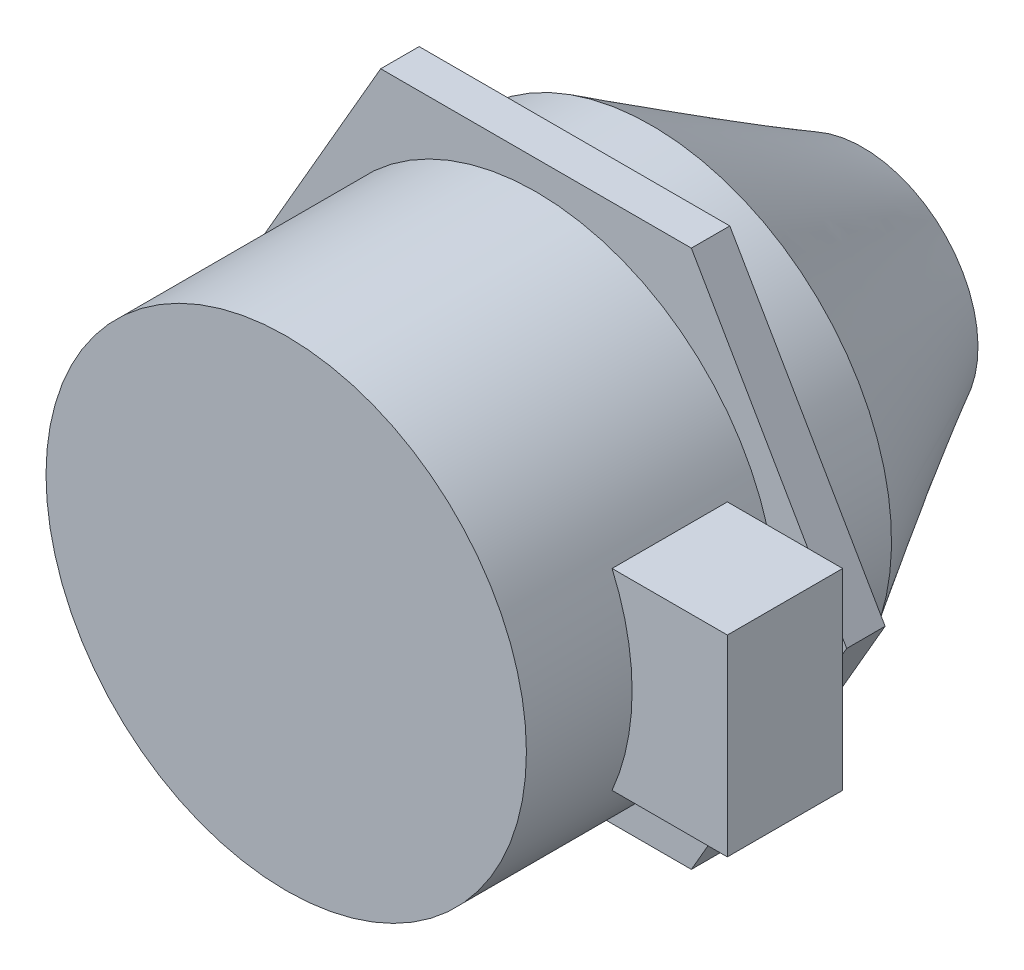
ISO-10303-21;
HEADER;
FILE_DESCRIPTION(('STEP AP214'),'2;1');
FILE_NAME('part.step','',(''),(''),'','','');
FILE_SCHEMA(('AUTOMOTIVE_DESIGN { 1 0 10303 214 1 1 1 1 }'));
ENDSEC;
DATA;
#1=APPLICATION_CONTEXT('core data for automotive mechanical design processes');
#2=APPLICATION_PROTOCOL_DEFINITION('international standard','automotive_design',2000,#1);
#3=PRODUCT_CONTEXT('',#1,'mechanical');
#4=PRODUCT('Part','Part','',(#3));
#5=PRODUCT_RELATED_PRODUCT_CATEGORY('part','',(#4));
#6=PRODUCT_DEFINITION_FORMATION('','',#4);
#7=PRODUCT_DEFINITION_CONTEXT('part definition',#1,'design');
#8=PRODUCT_DEFINITION('design','',#6,#7);
#9=PRODUCT_DEFINITION_SHAPE('','',#8);
#10=(LENGTH_UNIT() NAMED_UNIT(*) SI_UNIT(.MILLI.,.METRE.));
#11=(NAMED_UNIT(*) PLANE_ANGLE_UNIT() SI_UNIT($,.RADIAN.));
#12=(NAMED_UNIT(*) SI_UNIT($,.STERADIAN.) SOLID_ANGLE_UNIT());
#13=UNCERTAINTY_MEASURE_WITH_UNIT(LENGTH_MEASURE(1.E-05),#10,'distance_accuracy_value','');
#14=(GEOMETRIC_REPRESENTATION_CONTEXT(3) GLOBAL_UNCERTAINTY_ASSIGNED_CONTEXT((#13)) GLOBAL_UNIT_ASSIGNED_CONTEXT((#10,
#11,#12)) REPRESENTATION_CONTEXT('',''));
#15=CARTESIAN_POINT('',(0.,0.,0.));
#16=DIRECTION('',(0.,0.,1.));
#17=DIRECTION('',(1.,0.,0.));
#18=AXIS2_PLACEMENT_3D('',#15,#16,#17);
#19=CARTESIAN_POINT('',(0.,0.,-130.));
#20=DIRECTION('',(0.,0.,1.));
#21=DIRECTION('',(1.,0.,0.));
#22=AXIS2_PLACEMENT_3D('',#19,#20,#21);
#23=CYLINDRICAL_SURFACE('',#22,125.);
#24=CARTESIAN_POINT('',(0.,0.,-115.));
#25=DIRECTION('',(0.,0.,-1.));
#26=DIRECTION('',(-1.,0.,0.));
#27=AXIS2_PLACEMENT_3D('',#24,#25,#26);
#28=CIRCLE('',#27,125.);
#29=CARTESIAN_POINT('',(114.564392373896,50.,-115.));
#30=VERTEX_POINT('',#29);
#31=CARTESIAN_POINT('',(114.564392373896,-50.,-115.));
#32=VERTEX_POINT('',#31);
#33=EDGE_CURVE('E223',#30,#32,#28,.T.);
#34=ORIENTED_EDGE('',*,*,#33,.T.);
#35=DIRECTION('',(0.,0.,1.));
#36=VECTOR('',#35,1.);
#37=CARTESIAN_POINT('',(114.564392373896,-50.,-115.));
#38=LINE('',#37,#36);
#39=CARTESIAN_POINT('',(114.564392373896,-50.,-55.));
#40=VERTEX_POINT('',#39);
#41=EDGE_CURVE('E179',#32,#40,#38,.T.);
#42=ORIENTED_EDGE('',*,*,#41,.T.);
#43=CARTESIAN_POINT('',(0.,0.,-55.));
#44=DIRECTION('',(0.,0.,-1.));
#45=DIRECTION('',(-1.,0.,0.));
#46=AXIS2_PLACEMENT_3D('',#43,#44,#45);
#47=CIRCLE('',#46,125.);
#48=CARTESIAN_POINT('',(114.564392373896,50.,-55.));
#49=VERTEX_POINT('',#48);
#50=EDGE_CURVE('E380',#49,#40,#47,.T.);
#51=ORIENTED_EDGE('',*,*,#50,.F.);
#52=DIRECTION('',(0.,0.,1.));
#53=VECTOR('',#52,1.);
#54=CARTESIAN_POINT('',(114.564392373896,50.,-115.));
#55=LINE('',#54,#53);
#56=EDGE_CURVE('E372',#30,#49,#55,.T.);
#57=ORIENTED_EDGE('',*,*,#56,.F.);
#58=EDGE_LOOP('',(#34,#42,#51,#57));
#59=FACE_BOUND('',#58,.T.);
#60=CARTESIAN_POINT('',(0.,0.,-130.));
#61=DIRECTION('',(0.,0.,1.));
#62=DIRECTION('',(1.,0.,0.));
#63=AXIS2_PLACEMENT_3D('',#60,#61,#62);
#64=CIRCLE('',#63,125.);
#65=CARTESIAN_POINT('',(125.,0.,-130.));
#66=VERTEX_POINT('',#65);
#67=EDGE_CURVE('E164',#66,#66,#64,.T.);
#68=ORIENTED_EDGE('',*,*,#67,.T.);
#69=EDGE_LOOP('',(#68));
#70=FACE_BOUND('',#69,.T.);
#71=CARTESIAN_POINT('',(0.,0.,0.));
#72=DIRECTION('',(0.,0.,1.));
#73=DIRECTION('',(1.,0.,0.));
#74=AXIS2_PLACEMENT_3D('',#71,#72,#73);
#75=CIRCLE('',#74,125.);
#76=CARTESIAN_POINT('',(125.,0.,0.));
#77=VERTEX_POINT('',#76);
#78=EDGE_CURVE('E52',#77,#77,#75,.T.);
#79=ORIENTED_EDGE('',*,*,#78,.F.);
#80=EDGE_LOOP('',(#79));
#81=FACE_BOUND('',#80,.T.);
#82=ADVANCED_FACE('F44',(#59,#70,#81),#23,.T.);
#83=CARTESIAN_POINT('',(0.,0.,0.));
#84=DIRECTION('',(0.,0.,1.));
#85=DIRECTION('',(1.,0.,0.));
#86=AXIS2_PLACEMENT_3D('',#83,#84,#85);
#87=PLANE('',#86);
#88=ORIENTED_EDGE('',*,*,#78,.T.);
#89=EDGE_LOOP('',(#88));
#90=FACE_BOUND('',#89,.T.);
#91=ADVANCED_FACE('F203',(#90),#87,.T.);
#92=CARTESIAN_POINT('',(-161.658075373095,0.,-150.));
#93=DIRECTION('',(0.866025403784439,-0.5,0.));
#94=DIRECTION('',(0.5,0.866025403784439,0.));
#95=AXIS2_PLACEMENT_3D('',#92,#93,#94);
#96=PLANE('',#95);
#97=DIRECTION('',(0.5,0.866025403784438,0.));
#98=VECTOR('',#97,1.);
#99=CARTESIAN_POINT('',(-161.658075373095,0.,-130.));
#100=LINE('',#99,#98);
#101=CARTESIAN_POINT('',(-161.658075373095,0.,-130.));
#102=VERTEX_POINT('',#101);
#103=CARTESIAN_POINT('',(-80.8290376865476,140.,-130.));
#104=VERTEX_POINT('',#103);
#105=EDGE_CURVE('E143',#102,#104,#100,.T.);
#106=ORIENTED_EDGE('',*,*,#105,.T.);
#107=DIRECTION('',(0.,0.,1.));
#108=VECTOR('',#107,1.);
#109=CARTESIAN_POINT('',(-80.8290376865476,140.,-150.));
#110=LINE('',#109,#108);
#111=CARTESIAN_POINT('',(-80.8290376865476,140.,-150.));
#112=VERTEX_POINT('',#111);
#113=EDGE_CURVE('E162',#112,#104,#110,.T.);
#114=ORIENTED_EDGE('',*,*,#113,.F.);
#115=DIRECTION('',(0.5,0.866025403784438,0.));
#116=VECTOR('',#115,1.);
#117=CARTESIAN_POINT('',(-161.658075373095,0.,-150.));
#118=LINE('',#117,#116);
#119=CARTESIAN_POINT('',(-161.658075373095,0.,-150.));
#120=VERTEX_POINT('',#119);
#121=EDGE_CURVE('E155',#120,#112,#118,.T.);
#122=ORIENTED_EDGE('',*,*,#121,.F.);
#123=DIRECTION('',(0.,0.,1.));
#124=VECTOR('',#123,1.);
#125=CARTESIAN_POINT('',(-161.658075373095,0.,-150.));
#126=LINE('',#125,#124);
#127=EDGE_CURVE('E139',#120,#102,#126,.T.);
#128=ORIENTED_EDGE('',*,*,#127,.T.);
#129=EDGE_LOOP('',(#106,#114,#122,#128));
#130=FACE_BOUND('',#129,.T.);
#131=ADVANCED_FACE('F201',(#130),#96,.F.);
#132=CARTESIAN_POINT('',(-80.8290376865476,140.,-150.));
#133=DIRECTION('',(0.,-1.,0.));
#134=DIRECTION('',(1.,0.,0.));
#135=AXIS2_PLACEMENT_3D('',#132,#133,#134);
#136=PLANE('',#135);
#137=DIRECTION('',(1.,0.,0.));
#138=VECTOR('',#137,1.);
#139=CARTESIAN_POINT('',(-80.8290376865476,140.,-130.));
#140=LINE('',#139,#138);
#141=CARTESIAN_POINT('',(80.8290376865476,140.,-130.));
#142=VERTEX_POINT('',#141);
#143=EDGE_CURVE('E146',#104,#142,#140,.T.);
#144=ORIENTED_EDGE('',*,*,#143,.T.);
#145=DIRECTION('',(0.,0.,1.));
#146=VECTOR('',#145,1.);
#147=CARTESIAN_POINT('',(80.8290376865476,140.,-150.));
#148=LINE('',#147,#146);
#149=CARTESIAN_POINT('',(80.8290376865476,140.,-150.));
#150=VERTEX_POINT('',#149);
#151=EDGE_CURVE('E159',#150,#142,#148,.T.);
#152=ORIENTED_EDGE('',*,*,#151,.F.);
#153=DIRECTION('',(1.,0.,0.));
#154=VECTOR('',#153,1.);
#155=CARTESIAN_POINT('',(-80.8290376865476,140.,-150.));
#156=LINE('',#155,#154);
#157=EDGE_CURVE('E105',#112,#150,#156,.T.);
#158=ORIENTED_EDGE('',*,*,#157,.F.);
#159=ORIENTED_EDGE('',*,*,#113,.T.);
#160=EDGE_LOOP('',(#144,#152,#158,#159));
#161=FACE_BOUND('',#160,.T.);
#162=ADVANCED_FACE('F192',(#161),#136,.F.);
#163=CARTESIAN_POINT('',(80.8290376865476,140.,-150.));
#164=DIRECTION('',(-0.866025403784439,-0.5,0.));
#165=DIRECTION('',(0.5,-0.866025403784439,0.));
#166=AXIS2_PLACEMENT_3D('',#163,#164,#165);
#167=PLANE('',#166);
#168=DIRECTION('',(0.499999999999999,-0.866025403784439,0.));
#169=VECTOR('',#168,1.);
#170=CARTESIAN_POINT('',(80.8290376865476,140.,-130.));
#171=LINE('',#170,#169);
#172=CARTESIAN_POINT('',(161.658075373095,-1.11022302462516E-13,-130.));
#173=VERTEX_POINT('',#172);
#174=EDGE_CURVE('E149',#142,#173,#171,.T.);
#175=ORIENTED_EDGE('',*,*,#174,.T.);
#176=DIRECTION('',(0.,0.,1.));
#177=VECTOR('',#176,1.);
#178=CARTESIAN_POINT('',(161.658075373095,-1.11022302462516E-13,-150.));
#179=LINE('',#178,#177);
#180=CARTESIAN_POINT('',(161.658075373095,-1.11022302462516E-13,-150.));
#181=VERTEX_POINT('',#180);
#182=EDGE_CURVE('E134',#181,#173,#179,.T.);
#183=ORIENTED_EDGE('',*,*,#182,.F.);
#184=DIRECTION('',(0.499999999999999,-0.866025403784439,0.));
#185=VECTOR('',#184,1.);
#186=CARTESIAN_POINT('',(80.8290376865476,140.,-150.));
#187=LINE('',#186,#185);
#188=EDGE_CURVE('E122',#150,#181,#187,.T.);
#189=ORIENTED_EDGE('',*,*,#188,.F.);
#190=ORIENTED_EDGE('',*,*,#151,.T.);
#191=EDGE_LOOP('',(#175,#183,#189,#190));
#192=FACE_BOUND('',#191,.T.);
#193=ADVANCED_FACE('F195',(#192),#167,.F.);
#194=CARTESIAN_POINT('',(161.658075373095,-1.11022302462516E-13,-150.));
#195=DIRECTION('',(-0.866025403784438,0.5,0.));
#196=DIRECTION('',(-0.5,-0.866025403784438,0.));
#197=AXIS2_PLACEMENT_3D('',#194,#195,#196);
#198=PLANE('',#197);
#199=DIRECTION('',(-0.5,-0.866025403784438,0.));
#200=VECTOR('',#199,1.);
#201=CARTESIAN_POINT('',(161.658075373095,-1.11022302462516E-13,-130.));
#202=LINE('',#201,#200);
#203=CARTESIAN_POINT('',(80.8290376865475,-140.,-130.));
#204=VERTEX_POINT('',#203);
#205=EDGE_CURVE('E131',#173,#204,#202,.T.);
#206=ORIENTED_EDGE('',*,*,#205,.T.);
#207=DIRECTION('',(0.,0.,1.));
#208=VECTOR('',#207,1.);
#209=CARTESIAN_POINT('',(80.8290376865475,-140.,-150.));
#210=LINE('',#209,#208);
#211=CARTESIAN_POINT('',(80.8290376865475,-140.,-150.));
#212=VERTEX_POINT('',#211);
#213=EDGE_CURVE('E128',#212,#204,#210,.T.);
#214=ORIENTED_EDGE('',*,*,#213,.F.);
#215=DIRECTION('',(-0.5,-0.866025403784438,0.));
#216=VECTOR('',#215,1.);
#217=CARTESIAN_POINT('',(161.658075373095,-1.11022302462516E-13,-150.));
#218=LINE('',#217,#216);
#219=EDGE_CURVE('E115',#181,#212,#218,.T.);
#220=ORIENTED_EDGE('',*,*,#219,.F.);
#221=ORIENTED_EDGE('',*,*,#182,.T.);
#222=EDGE_LOOP('',(#206,#214,#220,#221));
#223=FACE_BOUND('',#222,.T.);
#224=ADVANCED_FACE('F129',(#223),#198,.F.);
#225=CARTESIAN_POINT('',(80.8290376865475,-140.,-150.));
#226=DIRECTION('',(0.,1.,0.));
#227=DIRECTION('',(-1.,0.,0.));
#228=AXIS2_PLACEMENT_3D('',#225,#226,#227);
#229=PLANE('',#228);
#230=DIRECTION('',(-1.,0.,0.));
#231=VECTOR('',#230,1.);
#232=CARTESIAN_POINT('',(80.8290376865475,-140.,-130.));
#233=LINE('',#232,#231);
#234=CARTESIAN_POINT('',(-80.8290376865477,-140.,-130.));
#235=VERTEX_POINT('',#234);
#236=EDGE_CURVE('E152',#204,#235,#233,.T.);
#237=ORIENTED_EDGE('',*,*,#236,.T.);
#238=DIRECTION('',(0.,0.,1.));
#239=VECTOR('',#238,1.);
#240=CARTESIAN_POINT('',(-80.8290376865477,-140.,-150.));
#241=LINE('',#240,#239);
#242=CARTESIAN_POINT('',(-80.8290376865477,-140.,-150.));
#243=VERTEX_POINT('',#242);
#244=EDGE_CURVE('E135',#243,#235,#241,.T.);
#245=ORIENTED_EDGE('',*,*,#244,.F.);
#246=DIRECTION('',(-1.,0.,0.));
#247=VECTOR('',#246,1.);
#248=CARTESIAN_POINT('',(80.8290376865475,-140.,-150.));
#249=LINE('',#248,#247);
#250=EDGE_CURVE('E119',#212,#243,#249,.T.);
#251=ORIENTED_EDGE('',*,*,#250,.F.);
#252=ORIENTED_EDGE('',*,*,#213,.T.);
#253=EDGE_LOOP('',(#237,#245,#251,#252));
#254=FACE_BOUND('',#253,.T.);
#255=ADVANCED_FACE('F137',(#254),#229,.F.);
#256=CARTESIAN_POINT('',(-80.8290376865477,-140.,-150.));
#257=DIRECTION('',(0.866025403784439,0.499999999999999,0.));
#258=DIRECTION('',(-0.499999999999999,0.866025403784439,0.));
#259=AXIS2_PLACEMENT_3D('',#256,#257,#258);
#260=PLANE('',#259);
#261=DIRECTION('',(-0.499999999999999,0.866025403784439,0.));
#262=VECTOR('',#261,1.);
#263=CARTESIAN_POINT('',(-80.8290376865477,-140.,-130.));
#264=LINE('',#263,#262);
#265=EDGE_CURVE('E96',#235,#102,#264,.T.);
#266=ORIENTED_EDGE('',*,*,#265,.T.);
#267=ORIENTED_EDGE('',*,*,#127,.F.);
#268=DIRECTION('',(-0.499999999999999,0.866025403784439,0.));
#269=VECTOR('',#268,1.);
#270=CARTESIAN_POINT('',(-80.8290376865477,-140.,-150.));
#271=LINE('',#270,#269);
#272=EDGE_CURVE('E69',#243,#120,#271,.T.);
#273=ORIENTED_EDGE('',*,*,#272,.F.);
#274=ORIENTED_EDGE('',*,*,#244,.T.);
#275=EDGE_LOOP('',(#266,#267,#273,#274));
#276=FACE_BOUND('',#275,.T.);
#277=ADVANCED_FACE('F199',(#276),#260,.F.);
#278=CARTESIAN_POINT('',(0.,0.,-150.));
#279=DIRECTION('',(0.,0.,-1.));
#280=DIRECTION('',(-1.,0.,0.));
#281=AXIS2_PLACEMENT_3D('',#278,#279,#280);
#282=PLANE('',#281);
#283=CARTESIAN_POINT('',(0.,0.,-150.));
#284=DIRECTION('',(0.,0.,-1.));
#285=DIRECTION('',(-1.,0.,0.));
#286=AXIS2_PLACEMENT_3D('',#283,#284,#285);
#287=CIRCLE('',#286,125.);
#288=CARTESIAN_POINT('',(-125.,0.,-150.));
#289=VERTEX_POINT('',#288);
#290=EDGE_CURVE('E12',#289,#289,#287,.T.);
#291=ORIENTED_EDGE('',*,*,#290,.F.);
#292=EDGE_LOOP('',(#291));
#293=FACE_BOUND('',#292,.T.);
#294=ORIENTED_EDGE('',*,*,#121,.T.);
#295=ORIENTED_EDGE('',*,*,#157,.T.);
#296=ORIENTED_EDGE('',*,*,#188,.T.);
#297=ORIENTED_EDGE('',*,*,#219,.T.);
#298=ORIENTED_EDGE('',*,*,#250,.T.);
#299=ORIENTED_EDGE('',*,*,#272,.T.);
#300=EDGE_LOOP('',(#294,#295,#296,#297,#298,#299));
#301=FACE_BOUND('',#300,.T.);
#302=ADVANCED_FACE('F117',(#293,#301),#282,.T.);
#303=CARTESIAN_POINT('',(0.,0.,-130.));
#304=DIRECTION('',(0.,0.,-1.));
#305=DIRECTION('',(-1.,0.,0.));
#306=AXIS2_PLACEMENT_3D('',#303,#304,#305);
#307=PLANE('',#306);
#308=ORIENTED_EDGE('',*,*,#67,.F.);
#309=EDGE_LOOP('',(#308));
#310=FACE_BOUND('',#309,.T.);
#311=ORIENTED_EDGE('',*,*,#105,.F.);
#312=ORIENTED_EDGE('',*,*,#265,.F.);
#313=ORIENTED_EDGE('',*,*,#236,.F.);
#314=ORIENTED_EDGE('',*,*,#205,.F.);
#315=ORIENTED_EDGE('',*,*,#174,.F.);
#316=ORIENTED_EDGE('',*,*,#143,.F.);
#317=EDGE_LOOP('',(#311,#312,#313,#314,#315,#316));
#318=FACE_BOUND('',#317,.T.);
#319=ADVANCED_FACE('F198',(#310,#318),#307,.F.);
#320=CARTESIAN_POINT('',(0.,0.,-190.));
#321=DIRECTION('',(0.,0.,1.));
#322=DIRECTION('',(1.,0.,0.));
#323=AXIS2_PLACEMENT_3D('',#320,#321,#322);
#324=CYLINDRICAL_SURFACE('',#323,125.);
#325=CARTESIAN_POINT('',(0.,0.,-190.));
#326=DIRECTION('',(0.,0.,1.));
#327=DIRECTION('',(1.,0.,0.));
#328=AXIS2_PLACEMENT_3D('',#325,#326,#327);
#329=CIRCLE('',#328,125.);
#330=CARTESIAN_POINT('',(124.717613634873,8.39743110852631,-190.));
#331=VERTEX_POINT('',#330);
#332=EDGE_CURVE('E147',#331,#331,#329,.F.);
#333=ORIENTED_EDGE('',*,*,#332,.F.);
#334=EDGE_LOOP('',(#333));
#335=FACE_BOUND('',#334,.T.);
#336=ORIENTED_EDGE('',*,*,#290,.T.);
#337=EDGE_LOOP('',(#336));
#338=FACE_BOUND('',#337,.T.);
#339=ADVANCED_FACE('F229',(#335,#338),#324,.T.);
#340=CARTESIAN_POINT('',(0.,0.,-300.));
#341=DIRECTION('',(0.,0.,1.));
#342=DIRECTION('',(1.,0.,0.));
#343=AXIS2_PLACEMENT_3D('',#340,#341,#342);
#344=PLANE('',#343);
#345=CARTESIAN_POINT('',(0.,0.,-300.));
#346=DIRECTION('',(0.,0.,1.));
#347=DIRECTION('',(1.,0.,0.));
#348=AXIS2_PLACEMENT_3D('',#345,#346,#347);
#349=CIRCLE('',#348,60.);
#350=CARTESIAN_POINT('',(58.4461440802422,-13.5664380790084,-300.));
#351=VERTEX_POINT('',#350);
#352=EDGE_CURVE('E169',#351,#351,#349,.T.);
#353=ORIENTED_EDGE('',*,*,#352,.F.);
#354=EDGE_LOOP('',(#353));
#355=FACE_BOUND('',#354,.T.);
#356=ADVANCED_FACE('F236',(#355),#344,.F.);
#357=CARTESIAN_POINT('',(124.717613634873,8.39743110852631,-190.));
#358=CARTESIAN_POINT('',(58.4461440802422,-13.5664380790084,-300.));
#359=CARTESIAN_POINT('',(141.512475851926,-241.03779616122,-190.));
#360=CARTESIAN_POINT('',(31.3132679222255,-130.458726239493,-300.));
#361=CARTESIAN_POINT('',(-107.922751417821,-257.832658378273,-190.));
#362=CARTESIAN_POINT('',(-85.5790202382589,-103.325850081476,-300.));
#363=CARTESIAN_POINT('',(-124.717613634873,-8.39743110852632,-190.));
#364=CARTESIAN_POINT('',(-58.4461440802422,13.5664380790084,-300.));
#365=CARTESIAN_POINT('',(-141.512475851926,241.03779616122,-190.));
#366=CARTESIAN_POINT('',(-31.3132679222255,130.458726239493,-300.));
#367=CARTESIAN_POINT('',(107.922751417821,257.832658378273,-190.));
#368=CARTESIAN_POINT('',(85.579020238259,103.325850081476,-300.));
#369=CARTESIAN_POINT('',(124.717613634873,8.39743110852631,-190.));
#370=CARTESIAN_POINT('',(58.4461440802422,-13.5664380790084,-300.));
#371=(BOUNDED_SURFACE() B_SPLINE_SURFACE(3,1,((#357,#358),(#359,#360),(#361,#362),(#363,#364),
(#365,#366),(#367,#368),(#369,#370)),.UNSPECIFIED.,.T.,.F.,.F.) B_SPLINE_SURFACE_WITH_KNOTS((4,
3,4),(2,2),(0.,0.5,1.),(0.,1.),
.UNSPECIFIED.) GEOMETRIC_REPRESENTATION_ITEM() RATIONAL_B_SPLINE_SURFACE(((1.,1.),
(0.333333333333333,0.333333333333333),(0.333333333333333,0.333333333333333),(1.,1.),
(0.333333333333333,0.333333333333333),(0.333333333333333,0.333333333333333),(1.,1.))) REPRESENTATION_ITEM('') SURFACE());
#372=CARTESIAN_POINT('',(124.717613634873,8.39743110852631,-190.));
#373=CARTESIAN_POINT('',(124.027285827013,8.16864080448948,-191.145833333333));
#374=CARTESIAN_POINT('',(123.336958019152,7.93985050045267,-192.291666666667));
#375=CARTESIAN_POINT('',(121.95630240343,7.48226989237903,-194.583333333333));
#376=CARTESIAN_POINT('',(121.26597459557,7.25347958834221,-195.729166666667));
#377=CARTESIAN_POINT('',(119.885318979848,6.79589898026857,-198.020833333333));
#378=CARTESIAN_POINT('',(119.194991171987,6.56710867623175,-199.166666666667));
#379=CARTESIAN_POINT('',(117.814335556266,6.10952806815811,-201.458333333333));
#380=CARTESIAN_POINT('',(117.124007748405,5.88073776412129,-202.604166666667));
#381=CARTESIAN_POINT('',(115.743352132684,5.42315715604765,-204.895833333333));
#382=CARTESIAN_POINT('',(115.053024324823,5.19436685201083,-206.041666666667));
#383=CARTESIAN_POINT('',(113.672368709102,4.73678624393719,-208.333333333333));
#384=CARTESIAN_POINT('',(112.982040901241,4.50799593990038,-209.479166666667));
#385=CARTESIAN_POINT('',(111.601385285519,4.05041533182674,-211.770833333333));
#386=CARTESIAN_POINT('',(110.911057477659,3.82162502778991,-212.916666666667));
#387=CARTESIAN_POINT('',(109.530401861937,3.36404441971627,-215.208333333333));
#388=CARTESIAN_POINT('',(108.840074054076,3.13525411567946,-216.354166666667));
#389=CARTESIAN_POINT('',(107.459418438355,2.67767350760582,-218.645833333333));
#390=CARTESIAN_POINT('',(106.769090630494,2.448883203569,-219.791666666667));
#391=CARTESIAN_POINT('',(105.388435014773,1.99130259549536,-222.083333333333));
#392=CARTESIAN_POINT('',(104.698107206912,1.76251229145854,-223.229166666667));
#393=CARTESIAN_POINT('',(103.31745159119,1.3049316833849,-225.520833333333));
#394=CARTESIAN_POINT('',(102.62712378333,1.07614137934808,-226.666666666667));
#395=CARTESIAN_POINT('',(101.246468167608,0.61856077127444,-228.958333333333));
#396=CARTESIAN_POINT('',(100.556140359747,0.38977046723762,-230.104166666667));
#397=CARTESIAN_POINT('',(99.175484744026,-0.0678101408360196,-232.395833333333));
#398=CARTESIAN_POINT('',(98.4851569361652,-0.296600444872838,-233.541666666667));
#399=CARTESIAN_POINT('',(97.1045013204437,-0.754181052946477,-235.833333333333));
#400=CARTESIAN_POINT('',(96.414173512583,-0.982971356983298,-236.979166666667));
#401=CARTESIAN_POINT('',(95.0335178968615,-1.44055196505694,-239.270833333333));
#402=CARTESIAN_POINT('',(94.3431900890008,-1.66934226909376,-240.416666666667));
#403=CARTESIAN_POINT('',(92.9625344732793,-2.1269228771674,-242.708333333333));
#404=CARTESIAN_POINT('',(92.2722066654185,-2.35571318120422,-243.854166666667));
#405=CARTESIAN_POINT('',(90.8915510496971,-2.81329378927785,-246.145833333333));
#406=CARTESIAN_POINT('',(90.2012232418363,-3.04208409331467,-247.291666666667));
#407=CARTESIAN_POINT('',(88.8205676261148,-3.49966470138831,-249.583333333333));
#408=CARTESIAN_POINT('',(88.1302398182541,-3.72845500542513,-250.729166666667));
#409=CARTESIAN_POINT('',(86.7495842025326,-4.18603561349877,-253.020833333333));
#410=CARTESIAN_POINT('',(86.0592563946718,-4.41482591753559,-254.166666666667));
#411=CARTESIAN_POINT('',(84.6786007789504,-4.87240652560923,-256.458333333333));
#412=CARTESIAN_POINT('',(83.9882729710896,-5.10119682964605,-257.604166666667));
#413=CARTESIAN_POINT('',(82.6076173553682,-5.55877743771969,-259.895833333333));
#414=CARTESIAN_POINT('',(81.9172895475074,-5.78756774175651,-261.041666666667));
#415=CARTESIAN_POINT('',(80.5366339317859,-6.24514834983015,-263.333333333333));
#416=CARTESIAN_POINT('',(79.8463061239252,-6.47393865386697,-264.479166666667));
#417=CARTESIAN_POINT('',(78.4656505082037,-6.93151926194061,-266.770833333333));
#418=CARTESIAN_POINT('',(77.775322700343,-7.16030956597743,-267.916666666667));
#419=CARTESIAN_POINT('',(76.3946670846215,-7.61789017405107,-270.208333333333));
#420=CARTESIAN_POINT('',(75.7043392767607,-7.84668047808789,-271.354166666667));
#421=CARTESIAN_POINT('',(74.3236836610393,-8.30426108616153,-273.645833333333));
#422=CARTESIAN_POINT('',(73.6333558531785,-8.53305139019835,-274.791666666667));
#423=CARTESIAN_POINT('',(72.252700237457,-8.99063199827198,-277.083333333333));
#424=CARTESIAN_POINT('',(71.5623724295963,-9.2194223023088,-278.229166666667));
#425=CARTESIAN_POINT('',(70.1817168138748,-9.67700291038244,-280.520833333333));
#426=CARTESIAN_POINT('',(69.4913890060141,-9.90579321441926,-281.666666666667));
#427=CARTESIAN_POINT('',(68.1107333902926,-10.3633738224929,-283.958333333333));
#428=CARTESIAN_POINT('',(67.4204055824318,-10.5921641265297,-285.104166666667));
#429=CARTESIAN_POINT('',(66.0397499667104,-11.0497447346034,-287.395833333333));
#430=CARTESIAN_POINT('',(65.3494221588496,-11.2785350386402,-288.541666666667));
#431=CARTESIAN_POINT('',(63.9687665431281,-11.7361156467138,-290.833333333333));
#432=CARTESIAN_POINT('',(63.2784387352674,-11.9649059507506,-291.979166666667));
#433=CARTESIAN_POINT('',(61.8977831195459,-12.4224865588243,-294.270833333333));
#434=CARTESIAN_POINT('',(61.2074553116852,-12.6512768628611,-295.416666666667));
#435=CARTESIAN_POINT('',(59.8267996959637,-13.1088574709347,-297.708333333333));
#436=CARTESIAN_POINT('',(59.1364718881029,-13.3376477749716,-298.854166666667));
#437=CARTESIAN_POINT('',(58.4461440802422,-13.5664380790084,-300.));
#438=B_SPLINE_CURVE_WITH_KNOTS('',3,(#372,#373,#374,#375,#376,#377,#378,#379,#380,#381,#382,
#383,#384,#385,#386,#387,#388,#389,#390,#391,#392,#393,#394,#395,#396,#397,#398,#399,#400,#401,
#402,#403,#404,#405,#406,#407,#408,#409,#410,#411,#412,#413,#414,#415,#416,#417,#418,#419,#420,
#421,#422,#423,#424,#425,#426,#427,#428,#429,#430,#431,#432,#433,#434,#435,#436,#437),
.UNSPECIFIED.,.F.,.F.,(4,2,2,2,2,2,2,2,2,2,2,2,2,2,2,2,2,2,2,2,2,2,2,2,2,2,2,2,2,2,2,2,4),(0.,
4.07142280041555,8.14284560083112,12.2142684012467,16.2856912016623,20.3571140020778,
24.4285368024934,28.4999596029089,32.5713824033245,36.6428052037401,40.7142280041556,
44.7856508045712,48.8570736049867,52.9284964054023,56.9999192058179,61.0713420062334,
65.142764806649,69.2141876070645,73.2856104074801,77.3570332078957,81.4284560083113,
85.4998788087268,89.5713016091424,93.6427244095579,97.7141472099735,101.785570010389,
105.856992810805,109.92841561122,113.999838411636,118.071261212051,122.142684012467,
126.214106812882,130.285529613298),.UNSPECIFIED.);
#439=EDGE_CURVE('BSEAM293',#331,#351,#438,.T.);
#440=ORIENTED_EDGE('',*,*,#332,.T.);
#441=ORIENTED_EDGE('',*,*,#352,.T.);
#442=ORIENTED_EDGE('',*,*,#439,.T.);
#443=ORIENTED_EDGE('',*,*,#439,.F.);
#444=EDGE_LOOP('',(#440,#442,#441,#443));
#445=FACE_BOUND('',#444,.T.);
#446=ADVANCED_FACE('F293',(#445),#371,.T.);
#447=CARTESIAN_POINT('',(174.564392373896,-50.,-115.));
#448=DIRECTION('',(1.,0.,0.));
#449=DIRECTION('',(0.,0.,-1.));
#450=AXIS2_PLACEMENT_3D('',#447,#448,#449);
#451=PLANE('',#450);
#452=DIRECTION('',(0.,1.,0.));
#453=VECTOR('',#452,1.);
#454=CARTESIAN_POINT('',(174.564392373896,-50.,-55.));
#455=LINE('',#454,#453);
#456=CARTESIAN_POINT('',(174.564392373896,-50.,-55.));
#457=VERTEX_POINT('',#456);
#458=CARTESIAN_POINT('',(174.564392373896,50.,-55.));
#459=VERTEX_POINT('',#458);
#460=EDGE_CURVE('E383',#457,#459,#455,.T.);
#461=ORIENTED_EDGE('',*,*,#460,.F.);
#462=DIRECTION('',(0.,0.,1.));
#463=VECTOR('',#462,1.);
#464=CARTESIAN_POINT('',(174.564392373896,-50.,-115.));
#465=LINE('',#464,#463);
#466=CARTESIAN_POINT('',(174.564392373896,-50.,-115.));
#467=VERTEX_POINT('',#466);
#468=EDGE_CURVE('E173',#467,#457,#465,.T.);
#469=ORIENTED_EDGE('',*,*,#468,.F.);
#470=DIRECTION('',(0.,1.,0.));
#471=VECTOR('',#470,1.);
#472=CARTESIAN_POINT('',(174.564392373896,-50.,-115.));
#473=LINE('',#472,#471);
#474=CARTESIAN_POINT('',(174.564392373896,50.,-115.));
#475=VERTEX_POINT('',#474);
#476=EDGE_CURVE('E379',#467,#475,#473,.T.);
#477=ORIENTED_EDGE('',*,*,#476,.T.);
#478=DIRECTION('',(0.,0.,1.));
#479=VECTOR('',#478,1.);
#480=CARTESIAN_POINT('',(174.564392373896,50.,-115.));
#481=LINE('',#480,#479);
#482=EDGE_CURVE('E369',#475,#459,#481,.T.);
#483=ORIENTED_EDGE('',*,*,#482,.T.);
#484=EDGE_LOOP('',(#461,#469,#477,#483));
#485=FACE_BOUND('',#484,.T.);
#486=ADVANCED_FACE('F301',(#485),#451,.T.);
#487=CARTESIAN_POINT('',(174.564392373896,-50.,-115.));
#488=DIRECTION('',(0.,-1.,0.));
#489=DIRECTION('',(0.,0.,-1.));
#490=AXIS2_PLACEMENT_3D('',#487,#488,#489);
#491=PLANE('',#490);
#492=DIRECTION('',(1.,0.,0.));
#493=VECTOR('',#492,1.);
#494=CARTESIAN_POINT('',(174.564392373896,-50.,-55.));
#495=LINE('',#494,#493);
#496=EDGE_CURVE('E376',#40,#457,#495,.T.);
#497=ORIENTED_EDGE('',*,*,#496,.F.);
#498=ORIENTED_EDGE('',*,*,#41,.F.);
#499=DIRECTION('',(1.,0.,0.));
#500=VECTOR('',#499,1.);
#501=CARTESIAN_POINT('',(174.564392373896,-50.,-115.));
#502=LINE('',#501,#500);
#503=EDGE_CURVE('E373',#32,#467,#502,.T.);
#504=ORIENTED_EDGE('',*,*,#503,.T.);
#505=ORIENTED_EDGE('',*,*,#468,.T.);
#506=EDGE_LOOP('',(#497,#498,#504,#505));
#507=FACE_BOUND('',#506,.T.);
#508=ADVANCED_FACE('F309',(#507),#491,.T.);
#509=CARTESIAN_POINT('',(174.564392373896,50.,-115.));
#510=DIRECTION('',(0.,1.,0.));
#511=DIRECTION('',(0.,0.,1.));
#512=AXIS2_PLACEMENT_3D('',#509,#510,#511);
#513=PLANE('',#512);
#514=DIRECTION('',(-1.,0.,0.));
#515=VECTOR('',#514,1.);
#516=CARTESIAN_POINT('',(174.564392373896,50.,-55.));
#517=LINE('',#516,#515);
#518=EDGE_CURVE('E60',#459,#49,#517,.T.);
#519=ORIENTED_EDGE('',*,*,#518,.F.);
#520=ORIENTED_EDGE('',*,*,#482,.F.);
#521=DIRECTION('',(-1.,0.,0.));
#522=VECTOR('',#521,1.);
#523=CARTESIAN_POINT('',(174.564392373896,50.,-115.));
#524=LINE('',#523,#522);
#525=EDGE_CURVE('E388',#475,#30,#524,.T.);
#526=ORIENTED_EDGE('',*,*,#525,.T.);
#527=ORIENTED_EDGE('',*,*,#56,.T.);
#528=EDGE_LOOP('',(#519,#520,#526,#527));
#529=FACE_BOUND('',#528,.T.);
#530=ADVANCED_FACE('F319',(#529),#513,.T.);
#531=CARTESIAN_POINT('',(0.,0.,-115.));
#532=DIRECTION('',(0.,0.,-1.));
#533=DIRECTION('',(-1.,0.,0.));
#534=AXIS2_PLACEMENT_3D('',#531,#532,#533);
#535=PLANE('',#534);
#536=ORIENTED_EDGE('',*,*,#476,.F.);
#537=ORIENTED_EDGE('',*,*,#503,.F.);
#538=ORIENTED_EDGE('',*,*,#33,.F.);
#539=ORIENTED_EDGE('',*,*,#525,.F.);
#540=EDGE_LOOP('',(#536,#537,#538,#539));
#541=FACE_BOUND('',#540,.T.);
#542=ADVANCED_FACE('F329',(#541),#535,.T.);
#543=CARTESIAN_POINT('',(0.,0.,-55.));
#544=DIRECTION('',(0.,0.,-1.));
#545=DIRECTION('',(-1.,0.,0.));
#546=AXIS2_PLACEMENT_3D('',#543,#544,#545);
#547=PLANE('',#546);
#548=ORIENTED_EDGE('',*,*,#460,.T.);
#549=ORIENTED_EDGE('',*,*,#518,.T.);
#550=ORIENTED_EDGE('',*,*,#50,.T.);
#551=ORIENTED_EDGE('',*,*,#496,.T.);
#552=EDGE_LOOP('',(#548,#549,#550,#551));
#553=FACE_BOUND('',#552,.T.);
#554=ADVANCED_FACE('F339',(#553),#547,.F.);
#555=CLOSED_SHELL('',(#82,#91,#131,#162,#193,#224,#255,#277,#302,#319,#339,#356,#446,#486,#508,
#530,#542,#554));
#556=MANIFOLD_SOLID_BREP('B2',#555);
#557=ADVANCED_BREP_SHAPE_REPRESENTATION('',(#18,#556),#14);
#558=SHAPE_DEFINITION_REPRESENTATION(#9,#557);
ENDSEC;
END-ISO-10303-21;
